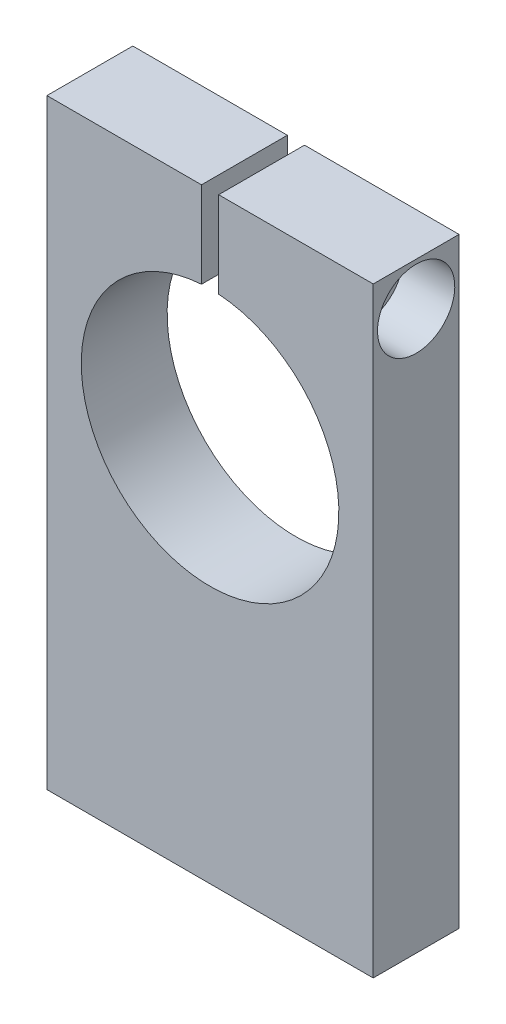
from build123d import *

# Parameters (mm, degrees)
EXTRUSION1_DEPTH        = 10
ESQUISSE2_W             = 2.1
ESQUISSE2_H             = 18
ESQUISSE6_R             = 4.5
ENL_V_MAT_EXTRU_1_DEPTH = 6
ESQUISSE7_R             = 2.75
ENL_V_MAT_EXTRU_2_DEPTH = 12
TROU_TARAUD_M52_D       = 4.2
TROU_TARAUD_M52_DEPTH   = 19
TROU_TARAUD_M52_TIP     = 1.2618073


with BuildPart() as part:
    # Esquisse1 → Extrusion1 (new body)
    with BuildSketch(Plane.XY):
        with BuildLine():
            Line((1, 25), (19, 25))
            Line((19, 25), (19, -45))
            Line((19, -45), (-19, -45))
            Line((-19, -45), (-19, 25))
            Line((-19, 25), (-1, 25))
            Line((-1, 25), (-1, 14.966629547))
            ThreePointArc((-1, 14.966629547), (0, -15), (1, 14.966629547))
            Line((1, 14.966629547), (1, 25))
        make_face()
    extrude(amount=EXTRUSION1_DEPTH)

    # Esquisse2 → Trou taraud_ M51 (revolve, cut)
    with BuildSketch(Plane(origin=(-1, 20, 5), x_dir=(0, 0, -1), z_dir=(0, 1, 0))):
        with Locations((1.05, 9)):
            Rectangle(ESQUISSE2_W, ESQUISSE2_H)
    revolve(axis=Axis((5.35, 20, 5), (-1, 0, 0)), mode=Mode.SUBTRACT)

    # Esquisse6 → Enl_v. mat.-Extru.1 (cut)
    with BuildSketch(Plane(origin=(19, 0, 0), x_dir=(0, 0, -1), z_dir=(1, 0, 0))):
        with Locations(Location((-5, 20, 0), (0, 0, 90))):
            Circle(ESQUISSE6_R)
    extrude(amount=-ENL_V_MAT_EXTRU_1_DEPTH, mode=Mode.SUBTRACT)

    # Esquisse7 → Enl_v. mat.-Extru.2 (cut)
    with BuildSketch(Plane(origin=(13, 0, 0), x_dir=(0, 0, -1), z_dir=(1, 0, 0))):
        with Locations(Location((-5, 20, 0), (0, 0, 90))):
            Circle(ESQUISSE7_R)
    extrude(amount=-ENL_V_MAT_EXTRU_2_DEPTH, mode=Mode.SUBTRACT)

    # Trou taraud_ M52
    with Locations(Plane.XZ.offset(45)):
        with Locations((-13, 5), (13, 5)):
            Hole(TROU_TARAUD_M52_D / 2, depth=TROU_TARAUD_M52_DEPTH)
            with Locations((0, 0, -(TROU_TARAUD_M52_DEPTH + TROU_TARAUD_M52_TIP / 2))):  # 118° drill point
                Cone(0, TROU_TARAUD_M52_D / 2, TROU_TARAUD_M52_TIP, mode=Mode.SUBTRACT)


solid = part.part
